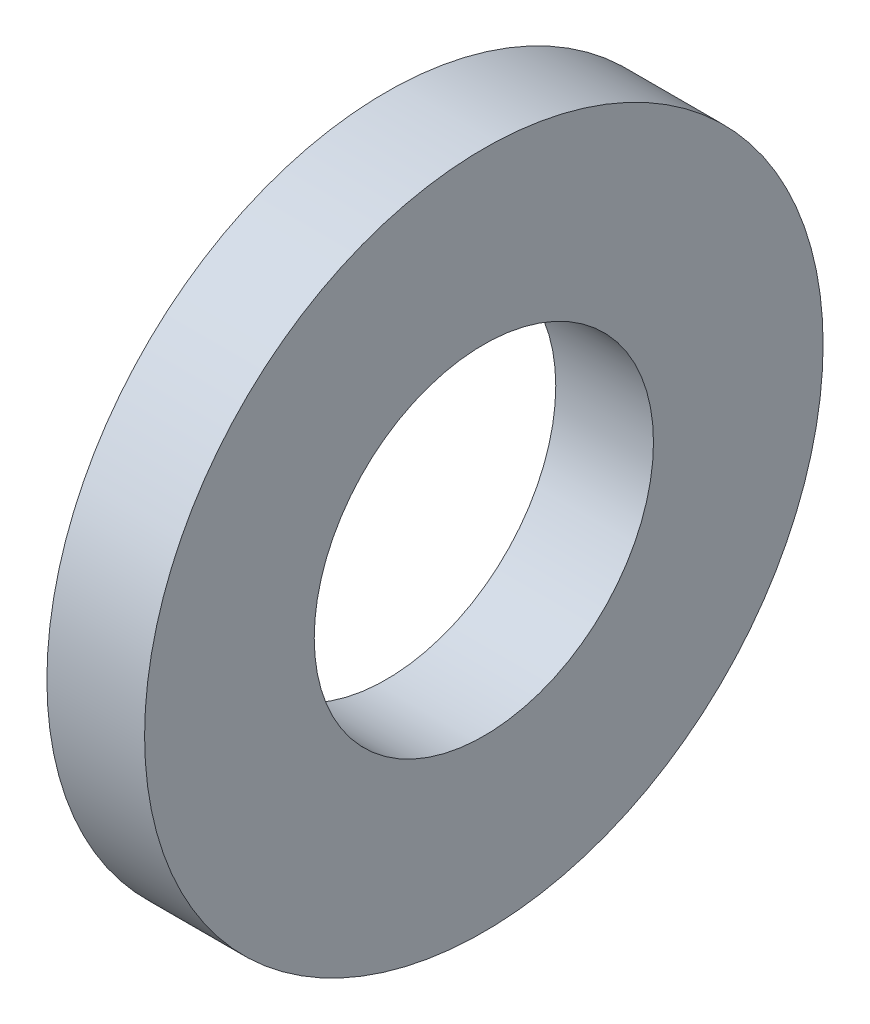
from build123d import *

# Parameters (mm, degrees)
SKETCH1_R           = 3.175
SKETCH1_R_2         = 1.5875
BOSS_EXTRUDE1_DEPTH = 0.9144


with BuildPart() as part:
    # Sketch1 → Boss-Extrude1 (new body)
    with BuildSketch(Plane(origin=(0, 0, 0), x_dir=(0, 0, -1), z_dir=(1, 0, 0))):
        Circle(SKETCH1_R)
        Circle(SKETCH1_R_2, mode=Mode.SUBTRACT)
    extrude(amount=BOSS_EXTRUDE1_DEPTH)


solid = part.part
